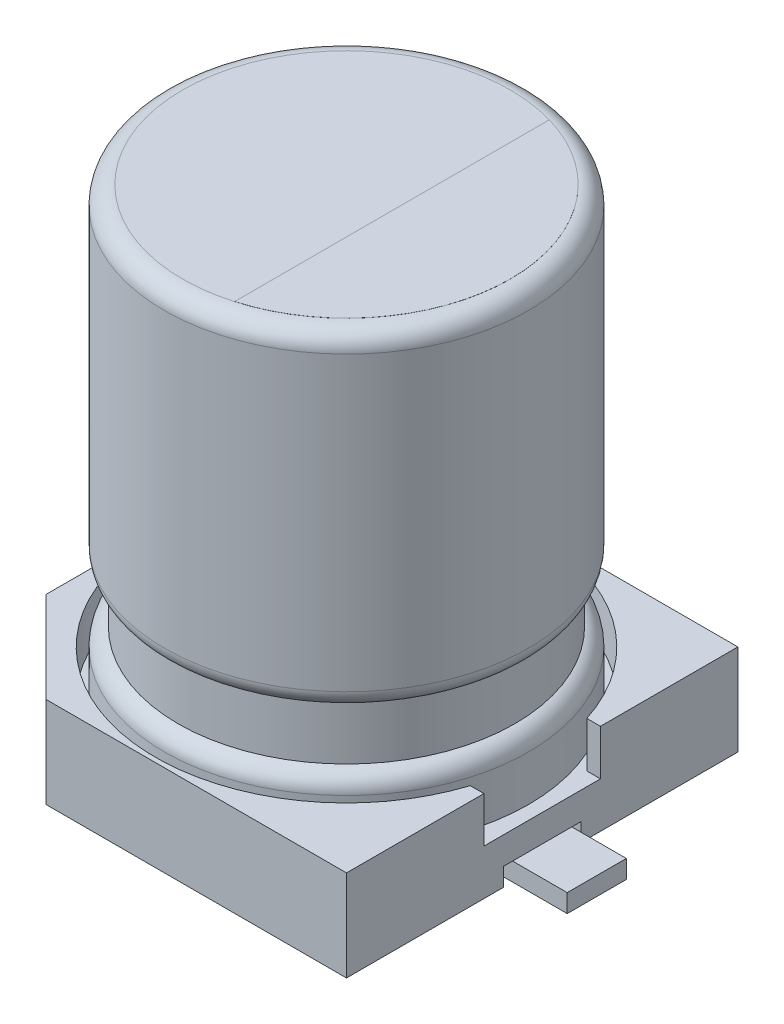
ISO-10303-21;
HEADER;
FILE_DESCRIPTION(('STEP AP214'),'2;1');
FILE_NAME('part.step','',(''),(''),'','','');
FILE_SCHEMA(('AUTOMOTIVE_DESIGN { 1 0 10303 214 1 1 1 1 }'));
ENDSEC;
DATA;
#1=APPLICATION_CONTEXT('core data for automotive mechanical design processes');
#2=APPLICATION_PROTOCOL_DEFINITION('international standard','automotive_design',2000,#1);
#3=PRODUCT_CONTEXT('',#1,'mechanical');
#4=PRODUCT('Part','Part','',(#3));
#5=PRODUCT_RELATED_PRODUCT_CATEGORY('part','',(#4));
#6=PRODUCT_DEFINITION_FORMATION('','',#4);
#7=PRODUCT_DEFINITION_CONTEXT('part definition',#1,'design');
#8=PRODUCT_DEFINITION('design','',#6,#7);
#9=PRODUCT_DEFINITION_SHAPE('','',#8);
#10=(LENGTH_UNIT() NAMED_UNIT(*) SI_UNIT(.MILLI.,.METRE.));
#11=(NAMED_UNIT(*) PLANE_ANGLE_UNIT() SI_UNIT($,.RADIAN.));
#12=(NAMED_UNIT(*) SI_UNIT($,.STERADIAN.) SOLID_ANGLE_UNIT());
#13=UNCERTAINTY_MEASURE_WITH_UNIT(LENGTH_MEASURE(1.E-05),#10,'distance_accuracy_value','');
#14=(GEOMETRIC_REPRESENTATION_CONTEXT(3) GLOBAL_UNCERTAINTY_ASSIGNED_CONTEXT((#13)) GLOBAL_UNIT_ASSIGNED_CONTEXT((#10,
#11,#12)) REPRESENTATION_CONTEXT('',''));
#15=CARTESIAN_POINT('',(0.,0.,0.));
#16=DIRECTION('',(0.,0.,1.));
#17=DIRECTION('',(1.,0.,0.));
#18=AXIS2_PLACEMENT_3D('',#15,#16,#17);
#19=CARTESIAN_POINT('',(0.4,0.2,0.425));
#20=DIRECTION('',(0.,-1.,0.));
#21=DIRECTION('',(1.,0.,0.));
#22=AXIS2_PLACEMENT_3D('',#19,#20,#21);
#23=PLANE('',#22);
#24=DIRECTION('',(0.,0.,-1.));
#25=VECTOR('',#24,1.);
#26=CARTESIAN_POINT('',(0.5,0.2,-0.325));
#27=LINE('',#26,#25);
#28=CARTESIAN_POINT('',(0.5,0.2,0.325));
#29=VERTEX_POINT('',#28);
#30=CARTESIAN_POINT('',(0.5,0.2,-0.325));
#31=VERTEX_POINT('',#30);
#32=EDGE_CURVE('E51',#29,#31,#27,.T.);
#33=ORIENTED_EDGE('',*,*,#32,.F.);
#34=DIRECTION('',(1.,0.,0.));
#35=VECTOR('',#34,1.);
#36=CARTESIAN_POINT('',(0.4,0.2,0.325));
#37=LINE('',#36,#35);
#38=CARTESIAN_POINT('',(2.15,0.2,0.324999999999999));
#39=VERTEX_POINT('',#38);
#40=EDGE_CURVE('E11',#29,#39,#37,.T.);
#41=ORIENTED_EDGE('',*,*,#40,.T.);
#42=DIRECTION('',(0.,0.,1.));
#43=VECTOR('',#42,1.);
#44=CARTESIAN_POINT('',(2.15,0.2,0.425000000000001));
#45=LINE('',#44,#43);
#46=CARTESIAN_POINT('',(2.15,0.2,0.425000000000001));
#47=VERTEX_POINT('',#46);
#48=EDGE_CURVE('E363',#39,#47,#45,.T.);
#49=ORIENTED_EDGE('',*,*,#48,.T.);
#50=DIRECTION('',(-1.,0.,0.));
#51=VECTOR('',#50,1.);
#52=CARTESIAN_POINT('',(2.15,0.2,0.425000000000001));
#53=LINE('',#52,#51);
#54=CARTESIAN_POINT('',(0.4,0.2,0.425));
#55=VERTEX_POINT('',#54);
#56=EDGE_CURVE('E350',#47,#55,#53,.T.);
#57=ORIENTED_EDGE('',*,*,#56,.T.);
#58=DIRECTION('',(0.,0.,-1.));
#59=VECTOR('',#58,1.);
#60=CARTESIAN_POINT('',(0.4,0.2,0.425));
#61=LINE('',#60,#59);
#62=CARTESIAN_POINT('',(0.4,0.2,-0.425));
#63=VERTEX_POINT('',#62);
#64=EDGE_CURVE('E354',#55,#63,#61,.T.);
#65=ORIENTED_EDGE('',*,*,#64,.T.);
#66=DIRECTION('',(1.,0.,0.));
#67=VECTOR('',#66,1.);
#68=CARTESIAN_POINT('',(2.15,0.2,-0.425000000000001));
#69=LINE('',#68,#67);
#70=CARTESIAN_POINT('',(2.15,0.2,-0.425000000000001));
#71=VERTEX_POINT('',#70);
#72=EDGE_CURVE('E359',#63,#71,#69,.T.);
#73=ORIENTED_EDGE('',*,*,#72,.T.);
#74=CARTESIAN_POINT('',(2.15,0.2,-0.325));
#75=VERTEX_POINT('',#74);
#76=EDGE_CURVE('E364',#71,#75,#45,.T.);
#77=ORIENTED_EDGE('',*,*,#76,.T.);
#78=DIRECTION('',(1.,0.,0.));
#79=VECTOR('',#78,1.);
#80=CARTESIAN_POINT('',(2.75,0.2,-0.325));
#81=LINE('',#80,#79);
#82=EDGE_CURVE('E288',#31,#75,#81,.T.);
#83=ORIENTED_EDGE('',*,*,#82,.F.);
#84=EDGE_LOOP('',(#33,#41,#49,#57,#65,#73,#77,#83));
#85=FACE_BOUND('',#84,.T.);
#86=ADVANCED_FACE('F35',(#85),#23,.T.);
#87=CARTESIAN_POINT('',(-2.15,0.2,-0.425));
#88=DIRECTION('',(0.,-1.,0.));
#89=DIRECTION('',(1.,0.,0.));
#90=AXIS2_PLACEMENT_3D('',#87,#88,#89);
#91=PLANE('',#90);
#92=DIRECTION('',(0.,0.,1.));
#93=VECTOR('',#92,1.);
#94=CARTESIAN_POINT('',(-0.5,0.2,-0.325));
#95=LINE('',#94,#93);
#96=CARTESIAN_POINT('',(-0.5,0.2,-0.325));
#97=VERTEX_POINT('',#96);
#98=CARTESIAN_POINT('',(-0.5,0.2,0.325));
#99=VERTEX_POINT('',#98);
#100=EDGE_CURVE('E59',#97,#99,#95,.T.);
#101=ORIENTED_EDGE('',*,*,#100,.F.);
#102=DIRECTION('',(-1.,0.,0.));
#103=VECTOR('',#102,1.);
#104=CARTESIAN_POINT('',(-2.15,0.2,-0.325));
#105=LINE('',#104,#103);
#106=CARTESIAN_POINT('',(-2.15,0.2,-0.325));
#107=VERTEX_POINT('',#106);
#108=EDGE_CURVE('E44',#97,#107,#105,.T.);
#109=ORIENTED_EDGE('',*,*,#108,.T.);
#110=DIRECTION('',(0.,0.,-1.));
#111=VECTOR('',#110,1.);
#112=CARTESIAN_POINT('',(-2.15,0.2,0.425));
#113=LINE('',#112,#111);
#114=CARTESIAN_POINT('',(-2.15,0.2,-0.425));
#115=VERTEX_POINT('',#114);
#116=EDGE_CURVE('E398',#107,#115,#113,.T.);
#117=ORIENTED_EDGE('',*,*,#116,.T.);
#118=DIRECTION('',(1.,0.,0.));
#119=VECTOR('',#118,1.);
#120=CARTESIAN_POINT('',(-2.15,0.2,-0.425));
#121=LINE('',#120,#119);
#122=CARTESIAN_POINT('',(-0.4,0.2,-0.425));
#123=VERTEX_POINT('',#122);
#124=EDGE_CURVE('E396',#115,#123,#121,.T.);
#125=ORIENTED_EDGE('',*,*,#124,.T.);
#126=DIRECTION('',(0.,0.,1.));
#127=VECTOR('',#126,1.);
#128=CARTESIAN_POINT('',(-0.4,0.2,0.425));
#129=LINE('',#128,#127);
#130=CARTESIAN_POINT('',(-0.4,0.2,0.425));
#131=VERTEX_POINT('',#130);
#132=EDGE_CURVE('E402',#123,#131,#129,.T.);
#133=ORIENTED_EDGE('',*,*,#132,.T.);
#134=DIRECTION('',(-1.,0.,0.));
#135=VECTOR('',#134,1.);
#136=CARTESIAN_POINT('',(-2.15,0.2,0.425));
#137=LINE('',#136,#135);
#138=CARTESIAN_POINT('',(-2.15,0.2,0.425));
#139=VERTEX_POINT('',#138);
#140=EDGE_CURVE('E406',#131,#139,#137,.T.);
#141=ORIENTED_EDGE('',*,*,#140,.T.);
#142=CARTESIAN_POINT('',(-2.15,0.2,0.325));
#143=VERTEX_POINT('',#142);
#144=EDGE_CURVE('E392',#139,#143,#113,.T.);
#145=ORIENTED_EDGE('',*,*,#144,.T.);
#146=DIRECTION('',(-1.,0.,0.));
#147=VECTOR('',#146,1.);
#148=CARTESIAN_POINT('',(-2.75,0.2,0.325));
#149=LINE('',#148,#147);
#150=EDGE_CURVE('E310',#99,#143,#149,.T.);
#151=ORIENTED_EDGE('',*,*,#150,.F.);
#152=EDGE_LOOP('',(#101,#109,#117,#125,#133,#141,#145,#151));
#153=FACE_BOUND('',#152,.T.);
#154=ADVANCED_FACE('F638',(#153),#91,.T.);
#155=CARTESIAN_POINT('',(2.15,0.5,-2.15));
#156=DIRECTION('',(0.,1.,0.));
#157=DIRECTION('',(0.,0.,1.));
#158=AXIS2_PLACEMENT_3D('',#155,#156,#157);
#159=PLANE('',#158);
#160=CARTESIAN_POINT('',(0.,0.5,0.));
#161=DIRECTION('',(0.,1.,0.));
#162=DIRECTION('',(0.,0.,1.));
#163=AXIS2_PLACEMENT_3D('',#160,#161,#162);
#164=CIRCLE('',#163,2.);
#165=CARTESIAN_POINT('',(0.,0.5,2.));
#166=VERTEX_POINT('',#165);
#167=EDGE_CURVE('E630',#166,#166,#164,.F.);
#168=ORIENTED_EDGE('',*,*,#167,.T.);
#169=EDGE_LOOP('',(#168));
#170=FACE_BOUND('',#169,.T.);
#171=CARTESIAN_POINT('',(0.,0.5,0.));
#172=DIRECTION('',(0.,-1.,0.));
#173=DIRECTION('',(0.,0.,1.));
#174=AXIS2_PLACEMENT_3D('',#171,#172,#173);
#175=CIRCLE('',#174,2.1);
#176=CARTESIAN_POINT('',(-2.,0.5,-0.640312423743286));
#177=VERTEX_POINT('',#176);
#178=CARTESIAN_POINT('',(2.,0.5,-0.640312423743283));
#179=VERTEX_POINT('',#178);
#180=EDGE_CURVE('E462',#177,#179,#175,.T.);
#181=ORIENTED_EDGE('',*,*,#180,.F.);
#182=DIRECTION('',(1.,0.,0.));
#183=VECTOR('',#182,1.);
#184=CARTESIAN_POINT('',(-2.15,0.5,-0.640312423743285));
#185=LINE('',#184,#183);
#186=CARTESIAN_POINT('',(-2.15,0.5,-0.640312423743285));
#187=VERTEX_POINT('',#186);
#188=EDGE_CURVE('E424',#187,#177,#185,.T.);
#189=ORIENTED_EDGE('',*,*,#188,.F.);
#190=DIRECTION('',(0.,0.,1.));
#191=VECTOR('',#190,1.);
#192=CARTESIAN_POINT('',(-2.15,0.5,1.15));
#193=LINE('',#192,#191);
#194=CARTESIAN_POINT('',(-2.15,0.5,0.640312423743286));
#195=VERTEX_POINT('',#194);
#196=EDGE_CURVE('E540',#187,#195,#193,.T.);
#197=ORIENTED_EDGE('',*,*,#196,.T.);
#198=DIRECTION('',(-1.,0.,0.));
#199=VECTOR('',#198,1.);
#200=CARTESIAN_POINT('',(-2.15,0.5,0.640312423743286));
#201=LINE('',#200,#199);
#202=CARTESIAN_POINT('',(-2.,0.5,0.640312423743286));
#203=VERTEX_POINT('',#202);
#204=EDGE_CURVE('E490',#203,#195,#201,.T.);
#205=ORIENTED_EDGE('',*,*,#204,.F.);
#206=CARTESIAN_POINT('',(0.,0.5,0.));
#207=DIRECTION('',(0.,-1.,0.));
#208=DIRECTION('',(0.,0.,1.));
#209=AXIS2_PLACEMENT_3D('',#206,#207,#208);
#210=CIRCLE('',#209,2.1);
#211=CARTESIAN_POINT('',(2.,0.5,0.640312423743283));
#212=VERTEX_POINT('',#211);
#213=EDGE_CURVE('E514',#212,#203,#210,.T.);
#214=ORIENTED_EDGE('',*,*,#213,.F.);
#215=DIRECTION('',(-1.,0.,0.));
#216=VECTOR('',#215,1.);
#217=CARTESIAN_POINT('',(2.,0.5,0.640312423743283));
#218=LINE('',#217,#216);
#219=CARTESIAN_POINT('',(2.15,0.5,0.640312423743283));
#220=VERTEX_POINT('',#219);
#221=EDGE_CURVE('E484',#220,#212,#218,.T.);
#222=ORIENTED_EDGE('',*,*,#221,.F.);
#223=DIRECTION('',(0.,0.,-1.));
#224=VECTOR('',#223,1.);
#225=CARTESIAN_POINT('',(2.15,0.5,2.15));
#226=LINE('',#225,#224);
#227=CARTESIAN_POINT('',(2.15,0.5,-0.640312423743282));
#228=VERTEX_POINT('',#227);
#229=EDGE_CURVE('E537',#220,#228,#226,.T.);
#230=ORIENTED_EDGE('',*,*,#229,.T.);
#231=DIRECTION('',(1.,0.,0.));
#232=VECTOR('',#231,1.);
#233=CARTESIAN_POINT('',(2.,0.5,-0.640312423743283));
#234=LINE('',#233,#232);
#235=EDGE_CURVE('E438',#179,#228,#234,.T.);
#236=ORIENTED_EDGE('',*,*,#235,.F.);
#237=EDGE_LOOP('',(#181,#189,#197,#205,#214,#222,#230,#236));
#238=FACE_BOUND('',#237,.T.);
#239=ADVANCED_FACE('F713',(#170,#238),#159,.T.);
#240=CARTESIAN_POINT('',(-1.8,5.4,0.));
#241=DIRECTION('',(0.,1.,0.));
#242=DIRECTION('',(-1.,0.,0.));
#243=AXIS2_PLACEMENT_3D('',#240,#241,#242);
#244=PLANE('',#243);
#245=CARTESIAN_POINT('',(0.,5.4,0.));
#246=DIRECTION('',(0.,1.,0.));
#247=DIRECTION('',(-1.,0.,0.));
#248=AXIS2_PLACEMENT_3D('',#245,#246,#247);
#249=CIRCLE('',#248,1.8);
#250=CARTESIAN_POINT('',(0.5,5.4,-1.72916164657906));
#251=VERTEX_POINT('',#250);
#252=CARTESIAN_POINT('',(0.5,5.4,1.72916164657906));
#253=VERTEX_POINT('',#252);
#254=EDGE_CURVE('E606',#251,#253,#249,.T.);
#255=ORIENTED_EDGE('',*,*,#254,.T.);
#256=DIRECTION('',(0.,0.,1.));
#257=VECTOR('',#256,1.);
#258=CARTESIAN_POINT('',(0.5,5.4,-1.72916164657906));
#259=LINE('',#258,#257);
#260=EDGE_CURVE('E588',#251,#253,#259,.T.);
#261=ORIENTED_EDGE('',*,*,#260,.F.);
#262=EDGE_LOOP('',(#255,#261));
#263=FACE_BOUND('',#262,.T.);
#264=ADVANCED_FACE('F684',(#263),#244,.T.);
#265=CARTESIAN_POINT('',(0.,5.4,0.));
#266=DIRECTION('',(0.,1.,0.));
#267=DIRECTION('',(-1.,0.,0.));
#268=AXIS2_PLACEMENT_3D('',#265,#266,#267);
#269=CYLINDRICAL_SURFACE('',#268,2.);
#270=ORIENTED_EDGE('',*,*,#167,.F.);
#271=EDGE_LOOP('',(#270));
#272=FACE_BOUND('',#271,.T.);
#273=CARTESIAN_POINT('',(0.,1.,0.));
#274=DIRECTION('',(0.,1.,0.));
#275=DIRECTION('',(-1.,0.,0.));
#276=AXIS2_PLACEMENT_3D('',#273,#274,#275);
#277=CIRCLE('',#276,2.);
#278=CARTESIAN_POINT('',(-2.,1.,0.));
#279=VERTEX_POINT('',#278);
#280=EDGE_CURVE('E626',#279,#279,#277,.T.);
#281=ORIENTED_EDGE('',*,*,#280,.F.);
#282=EDGE_LOOP('',(#281));
#283=FACE_BOUND('',#282,.T.);
#284=ADVANCED_FACE('F1174',(#272,#283),#269,.T.);
#285=CARTESIAN_POINT('',(0.,1.,0.));
#286=DIRECTION('',(0.,1.,0.));
#287=DIRECTION('',(-1.,0.,0.));
#288=AXIS2_PLACEMENT_3D('',#285,#286,#287);
#289=TOROIDAL_SURFACE('',#288,1.8,0.2);
#290=ORIENTED_EDGE('',*,*,#280,.T.);
#291=EDGE_LOOP('',(#290));
#292=FACE_BOUND('',#291,.T.);
#293=CARTESIAN_POINT('',(0.,1.19364916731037,0.));
#294=DIRECTION('',(0.,1.,0.));
#295=DIRECTION('',(-1.,0.,0.));
#296=AXIS2_PLACEMENT_3D('',#293,#294,#295);
#297=CIRCLE('',#296,1.85);
#298=CARTESIAN_POINT('',(-1.85,1.19364916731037,0.));
#299=VERTEX_POINT('',#298);
#300=EDGE_CURVE('E622',#299,#299,#297,.T.);
#301=ORIENTED_EDGE('',*,*,#300,.F.);
#302=EDGE_LOOP('',(#301));
#303=FACE_BOUND('',#302,.T.);
#304=ADVANCED_FACE('F1212',(#292,#303),#289,.T.);
#305=CARTESIAN_POINT('',(0.,5.4,0.));
#306=DIRECTION('',(0.,1.,0.));
#307=DIRECTION('',(-1.,0.,0.));
#308=AXIS2_PLACEMENT_3D('',#305,#306,#307);
#309=CYLINDRICAL_SURFACE('',#308,1.85);
#310=ORIENTED_EDGE('',*,*,#300,.T.);
#311=EDGE_LOOP('',(#310));
#312=FACE_BOUND('',#311,.T.);
#313=CARTESIAN_POINT('',(0.,1.79364916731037,0.));
#314=DIRECTION('',(0.,1.,0.));
#315=DIRECTION('',(-1.,0.,0.));
#316=AXIS2_PLACEMENT_3D('',#313,#314,#315);
#317=CIRCLE('',#316,1.85);
#318=CARTESIAN_POINT('',(-1.85,1.79364916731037,0.));
#319=VERTEX_POINT('',#318);
#320=EDGE_CURVE('E618',#319,#319,#317,.T.);
#321=ORIENTED_EDGE('',*,*,#320,.F.);
#322=EDGE_LOOP('',(#321));
#323=FACE_BOUND('',#322,.T.);
#324=ADVANCED_FACE('F1202',(#312,#323),#309,.T.);
#325=CARTESIAN_POINT('',(0.,1.98729833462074,0.));
#326=DIRECTION('',(0.,1.,0.));
#327=DIRECTION('',(-1.,0.,0.));
#328=AXIS2_PLACEMENT_3D('',#325,#326,#327);
#329=TOROIDAL_SURFACE('',#328,1.8,0.2);
#330=ORIENTED_EDGE('',*,*,#320,.T.);
#331=EDGE_LOOP('',(#330));
#332=FACE_BOUND('',#331,.T.);
#333=CARTESIAN_POINT('',(0.,1.98729833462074,0.));
#334=DIRECTION('',(0.,1.,0.));
#335=DIRECTION('',(-1.,0.,0.));
#336=AXIS2_PLACEMENT_3D('',#333,#334,#335);
#337=CIRCLE('',#336,2.);
#338=CARTESIAN_POINT('',(-2.,1.98729833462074,0.));
#339=VERTEX_POINT('',#338);
#340=EDGE_CURVE('E614',#339,#339,#337,.T.);
#341=ORIENTED_EDGE('',*,*,#340,.F.);
#342=EDGE_LOOP('',(#341));
#343=FACE_BOUND('',#342,.T.);
#344=ADVANCED_FACE('F1192',(#332,#343),#329,.T.);
#345=CARTESIAN_POINT('',(0.,5.4,0.));
#346=DIRECTION('',(0.,1.,0.));
#347=DIRECTION('',(-1.,0.,0.));
#348=AXIS2_PLACEMENT_3D('',#345,#346,#347);
#349=CYLINDRICAL_SURFACE('',#348,2.);
#350=ORIENTED_EDGE('',*,*,#340,.T.);
#351=EDGE_LOOP('',(#350));
#352=FACE_BOUND('',#351,.T.);
#353=CARTESIAN_POINT('',(0.,5.2,0.));
#354=DIRECTION('',(0.,1.,0.));
#355=DIRECTION('',(-1.,0.,0.));
#356=AXIS2_PLACEMENT_3D('',#353,#354,#355);
#357=CIRCLE('',#356,2.);
#358=CARTESIAN_POINT('',(-2.,5.2,0.));
#359=VERTEX_POINT('',#358);
#360=EDGE_CURVE('E610',#359,#359,#357,.T.);
#361=ORIENTED_EDGE('',*,*,#360,.F.);
#362=EDGE_LOOP('',(#361));
#363=FACE_BOUND('',#362,.T.);
#364=ADVANCED_FACE('F1183',(#352,#363),#349,.T.);
#365=CARTESIAN_POINT('',(0.,5.2,0.));
#366=DIRECTION('',(0.,1.,0.));
#367=DIRECTION('',(-1.,0.,0.));
#368=AXIS2_PLACEMENT_3D('',#365,#366,#367);
#369=TOROIDAL_SURFACE('',#368,1.8,0.2);
#370=ORIENTED_EDGE('',*,*,#360,.T.);
#371=EDGE_LOOP('',(#370));
#372=FACE_BOUND('',#371,.T.);
#373=EDGE_CURVE('E607',#253,#251,#249,.T.);
#374=ORIENTED_EDGE('',*,*,#373,.F.);
#375=ORIENTED_EDGE('',*,*,#254,.F.);
#376=EDGE_LOOP('',(#374,#375));
#377=FACE_BOUND('',#376,.T.);
#378=ADVANCED_FACE('F686',(#372,#377),#369,.T.);
#379=CARTESIAN_POINT('',(0.,5.401,0.));
#380=DIRECTION('',(0.,-1.,0.));
#381=DIRECTION('',(1.,0.,0.));
#382=AXIS2_PLACEMENT_3D('',#379,#380,#381);
#383=CYLINDRICAL_SURFACE('',#382,1.8);
#384=ORIENTED_EDGE('',*,*,#373,.T.);
#385=DIRECTION('',(0.,-1.,0.));
#386=VECTOR('',#385,1.);
#387=CARTESIAN_POINT('',(0.5,5.401,-1.72916164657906));
#388=LINE('',#387,#386);
#389=CARTESIAN_POINT('',(0.5,5.401,-1.72916164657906));
#390=VERTEX_POINT('',#389);
#391=EDGE_CURVE('E602',#390,#251,#388,.T.);
#392=ORIENTED_EDGE('',*,*,#391,.F.);
#393=CARTESIAN_POINT('',(0.,5.401,0.));
#394=DIRECTION('',(0.,1.,0.));
#395=DIRECTION('',(-1.,0.,0.));
#396=AXIS2_PLACEMENT_3D('',#393,#394,#395);
#397=CIRCLE('',#396,1.8);
#398=CARTESIAN_POINT('',(0.5,5.401,1.72916164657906));
#399=VERTEX_POINT('',#398);
#400=EDGE_CURVE('E589',#399,#390,#397,.T.);
#401=ORIENTED_EDGE('',*,*,#400,.F.);
#402=DIRECTION('',(0.,-1.,0.));
#403=VECTOR('',#402,1.);
#404=CARTESIAN_POINT('',(0.5,5.401,1.72916164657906));
#405=LINE('',#404,#403);
#406=EDGE_CURVE('E596',#399,#253,#405,.T.);
#407=ORIENTED_EDGE('',*,*,#406,.T.);
#408=EDGE_LOOP('',(#384,#392,#401,#407));
#409=FACE_BOUND('',#408,.T.);
#410=ADVANCED_FACE('F689',(#409),#383,.T.);
#411=CARTESIAN_POINT('',(0.5,5.401,-1.72916164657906));
#412=DIRECTION('',(1.,0.,0.));
#413=DIRECTION('',(0.,1.,0.));
#414=AXIS2_PLACEMENT_3D('',#411,#412,#413);
#415=PLANE('',#414);
#416=ORIENTED_EDGE('',*,*,#260,.T.);
#417=ORIENTED_EDGE('',*,*,#406,.F.);
#418=DIRECTION('',(0.,0.,1.));
#419=VECTOR('',#418,1.);
#420=CARTESIAN_POINT('',(0.5,5.401,-1.72916164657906));
#421=LINE('',#420,#419);
#422=EDGE_CURVE('E593',#390,#399,#421,.T.);
#423=ORIENTED_EDGE('',*,*,#422,.F.);
#424=ORIENTED_EDGE('',*,*,#391,.T.);
#425=EDGE_LOOP('',(#416,#417,#423,#424));
#426=FACE_BOUND('',#425,.T.);
#427=ADVANCED_FACE('F693',(#426),#415,.F.);
#428=CARTESIAN_POINT('',(0.,5.401,0.));
#429=DIRECTION('',(0.,1.,0.));
#430=DIRECTION('',(-1.,0.,0.));
#431=AXIS2_PLACEMENT_3D('',#428,#429,#430);
#432=PLANE('',#431);
#433=ORIENTED_EDGE('',*,*,#400,.T.);
#434=ORIENTED_EDGE('',*,*,#422,.T.);
#435=EDGE_LOOP('',(#433,#434));
#436=FACE_BOUND('',#435,.T.);
#437=ADVANCED_FACE('F695',(#436),#432,.T.);
#438=CARTESIAN_POINT('',(2.15,0.5,2.15));
#439=DIRECTION('',(-1.,0.,0.));
#440=DIRECTION('',(0.,0.,1.));
#441=AXIS2_PLACEMENT_3D('',#438,#439,#440);
#442=PLANE('',#441);
#443=DIRECTION('',(0.,0.,-1.));
#444=VECTOR('',#443,1.);
#445=CARTESIAN_POINT('',(2.15,0.,2.15));
#446=LINE('',#445,#444);
#447=CARTESIAN_POINT('',(2.15,0.,2.15));
#448=VERTEX_POINT('',#447);
#449=CARTESIAN_POINT('',(2.15,0.,0.425000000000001));
#450=VERTEX_POINT('',#449);
#451=EDGE_CURVE('E545',#448,#450,#446,.T.);
#452=ORIENTED_EDGE('',*,*,#451,.T.);
#453=DIRECTION('',(0.,-1.,0.));
#454=VECTOR('',#453,1.);
#455=CARTESIAN_POINT('',(2.15,0.2,0.425000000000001));
#456=LINE('',#455,#454);
#457=EDGE_CURVE('E378',#47,#450,#456,.T.);
#458=ORIENTED_EDGE('',*,*,#457,.F.);
#459=ORIENTED_EDGE('',*,*,#48,.F.);
#460=EDGE_CURVE('E369',#75,#39,#45,.T.);
#461=ORIENTED_EDGE('',*,*,#460,.F.);
#462=ORIENTED_EDGE('',*,*,#76,.F.);
#463=DIRECTION('',(0.,-1.,0.));
#464=VECTOR('',#463,1.);
#465=CARTESIAN_POINT('',(2.15,0.2,-0.425000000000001));
#466=LINE('',#465,#464);
#467=CARTESIAN_POINT('',(2.15,0.,-0.425000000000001));
#468=VERTEX_POINT('',#467);
#469=EDGE_CURVE('E382',#71,#468,#466,.T.);
#470=ORIENTED_EDGE('',*,*,#469,.T.);
#471=CARTESIAN_POINT('',(2.15,0.,-2.15));
#472=VERTEX_POINT('',#471);
#473=EDGE_CURVE('E536',#468,#472,#446,.T.);
#474=ORIENTED_EDGE('',*,*,#473,.T.);
#475=DIRECTION('',(0.,-1.,0.));
#476=VECTOR('',#475,1.);
#477=CARTESIAN_POINT('',(2.15,0.5,-2.15));
#478=LINE('',#477,#476);
#479=CARTESIAN_POINT('',(2.15,1.,-2.15));
#480=VERTEX_POINT('',#479);
#481=EDGE_CURVE('E584',#480,#472,#478,.T.);
#482=ORIENTED_EDGE('',*,*,#481,.F.);
#483=DIRECTION('',(0.,0.,-1.));
#484=VECTOR('',#483,1.);
#485=CARTESIAN_POINT('',(2.15,1.,-0.640312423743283));
#486=LINE('',#485,#484);
#487=CARTESIAN_POINT('',(2.15,1.,-0.640312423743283));
#488=VERTEX_POINT('',#487);
#489=EDGE_CURVE('E433',#488,#480,#486,.T.);
#490=ORIENTED_EDGE('',*,*,#489,.F.);
#491=DIRECTION('',(0.,-1.,0.));
#492=VECTOR('',#491,1.);
#493=CARTESIAN_POINT('',(2.15,1.,-0.640312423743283));
#494=LINE('',#493,#492);
#495=EDGE_CURVE('E458',#488,#228,#494,.T.);
#496=ORIENTED_EDGE('',*,*,#495,.T.);
#497=ORIENTED_EDGE('',*,*,#229,.F.);
#498=DIRECTION('',(0.,-1.,0.));
#499=VECTOR('',#498,1.);
#500=CARTESIAN_POINT('',(2.15,1.,0.640312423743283));
#501=LINE('',#500,#499);
#502=CARTESIAN_POINT('',(2.15,1.,0.640312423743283));
#503=VERTEX_POINT('',#502);
#504=EDGE_CURVE('E532',#503,#220,#501,.T.);
#505=ORIENTED_EDGE('',*,*,#504,.F.);
#506=DIRECTION('',(0.,0.,-1.));
#507=VECTOR('',#506,1.);
#508=CARTESIAN_POINT('',(2.15,1.,2.15));
#509=LINE('',#508,#507);
#510=CARTESIAN_POINT('',(2.15,1.,2.15));
#511=VERTEX_POINT('',#510);
#512=EDGE_CURVE('E489',#511,#503,#509,.T.);
#513=ORIENTED_EDGE('',*,*,#512,.F.);
#514=DIRECTION('',(0.,-1.,0.));
#515=VECTOR('',#514,1.);
#516=CARTESIAN_POINT('',(2.15,0.5,2.15));
#517=LINE('',#516,#515);
#518=EDGE_CURVE('E544',#511,#448,#517,.T.);
#519=ORIENTED_EDGE('',*,*,#518,.T.);
#520=EDGE_LOOP('',(#452,#458,#459,#461,#462,#470,#474,#482,#490,#496,#497,#505,#513,#519));
#521=FACE_BOUND('',#520,.T.);
#522=ADVANCED_FACE('F697',(#521),#442,.F.);
#523=CARTESIAN_POINT('',(2.15,0.5,-2.15));
#524=DIRECTION('',(0.,0.,1.));
#525=DIRECTION('',(1.,0.,0.));
#526=AXIS2_PLACEMENT_3D('',#523,#524,#525);
#527=PLANE('',#526);
#528=DIRECTION('',(-1.,0.,0.));
#529=VECTOR('',#528,1.);
#530=CARTESIAN_POINT('',(2.15,0.,-2.15));
#531=LINE('',#530,#529);
#532=CARTESIAN_POINT('',(-1.15,0.,-2.15));
#533=VERTEX_POINT('',#532);
#534=EDGE_CURVE('E549',#472,#533,#531,.T.);
#535=ORIENTED_EDGE('',*,*,#534,.T.);
#536=DIRECTION('',(0.,-1.,0.));
#537=VECTOR('',#536,1.);
#538=CARTESIAN_POINT('',(-1.15,0.5,-2.15));
#539=LINE('',#538,#537);
#540=CARTESIAN_POINT('',(-1.15,1.,-2.15));
#541=VERTEX_POINT('',#540);
#542=EDGE_CURVE('E580',#541,#533,#539,.T.);
#543=ORIENTED_EDGE('',*,*,#542,.F.);
#544=DIRECTION('',(-1.,0.,0.));
#545=VECTOR('',#544,1.);
#546=CARTESIAN_POINT('',(2.15,1.,-2.15));
#547=LINE('',#546,#545);
#548=EDGE_CURVE('E437',#480,#541,#547,.T.);
#549=ORIENTED_EDGE('',*,*,#548,.F.);
#550=ORIENTED_EDGE('',*,*,#481,.T.);
#551=EDGE_LOOP('',(#535,#543,#549,#550));
#552=FACE_BOUND('',#551,.T.);
#553=ADVANCED_FACE('F703',(#552),#527,.F.);
#554=CARTESIAN_POINT('',(-1.15,0.5,-2.15));
#555=DIRECTION('',(0.707106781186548,0.,0.707106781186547));
#556=DIRECTION('',(0.707106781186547,0.,-0.707106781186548));
#557=AXIS2_PLACEMENT_3D('',#554,#555,#556);
#558=PLANE('',#557);
#559=DIRECTION('',(-0.707106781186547,0.,0.707106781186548));
#560=VECTOR('',#559,1.);
#561=CARTESIAN_POINT('',(-1.15,0.,-2.15));
#562=LINE('',#561,#560);
#563=CARTESIAN_POINT('',(-2.15,0.,-1.15));
#564=VERTEX_POINT('',#563);
#565=EDGE_CURVE('E552',#533,#564,#562,.T.);
#566=ORIENTED_EDGE('',*,*,#565,.T.);
#567=DIRECTION('',(0.,-1.,0.));
#568=VECTOR('',#567,1.);
#569=CARTESIAN_POINT('',(-2.15,0.5,-1.15));
#570=LINE('',#569,#568);
#571=CARTESIAN_POINT('',(-2.15,1.,-1.15));
#572=VERTEX_POINT('',#571);
#573=EDGE_CURVE('E576',#572,#564,#570,.T.);
#574=ORIENTED_EDGE('',*,*,#573,.F.);
#575=DIRECTION('',(-0.707106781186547,0.,0.707106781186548));
#576=VECTOR('',#575,1.);
#577=CARTESIAN_POINT('',(-1.15,1.,-2.15));
#578=LINE('',#577,#576);
#579=EDGE_CURVE('E442',#541,#572,#578,.T.);
#580=ORIENTED_EDGE('',*,*,#579,.F.);
#581=ORIENTED_EDGE('',*,*,#542,.T.);
#582=EDGE_LOOP('',(#566,#574,#580,#581));
#583=FACE_BOUND('',#582,.T.);
#584=ADVANCED_FACE('F786',(#583),#558,.F.);
#585=CARTESIAN_POINT('',(-2.15,0.5,1.15));
#586=DIRECTION('',(1.,0.,0.));
#587=DIRECTION('',(0.,0.,-1.));
#588=AXIS2_PLACEMENT_3D('',#585,#586,#587);
#589=PLANE('',#588);
#590=ORIENTED_EDGE('',*,*,#144,.F.);
#591=DIRECTION('',(0.,-1.,0.));
#592=VECTOR('',#591,1.);
#593=CARTESIAN_POINT('',(-2.15,0.2,0.425));
#594=LINE('',#593,#592);
#595=CARTESIAN_POINT('',(-2.15,0.,0.425));
#596=VERTEX_POINT('',#595);
#597=EDGE_CURVE('E420',#139,#596,#594,.T.);
#598=ORIENTED_EDGE('',*,*,#597,.T.);
#599=DIRECTION('',(0.,0.,1.));
#600=VECTOR('',#599,1.);
#601=CARTESIAN_POINT('',(-2.15,0.,1.15));
#602=LINE('',#601,#600);
#603=CARTESIAN_POINT('',(-2.15,0.,1.15));
#604=VERTEX_POINT('',#603);
#605=EDGE_CURVE('E555',#596,#604,#602,.T.);
#606=ORIENTED_EDGE('',*,*,#605,.T.);
#607=DIRECTION('',(0.,-1.,0.));
#608=VECTOR('',#607,1.);
#609=CARTESIAN_POINT('',(-2.15,0.5,1.15));
#610=LINE('',#609,#608);
#611=CARTESIAN_POINT('',(-2.15,1.,1.15));
#612=VERTEX_POINT('',#611);
#613=EDGE_CURVE('E572',#612,#604,#610,.T.);
#614=ORIENTED_EDGE('',*,*,#613,.F.);
#615=DIRECTION('',(0.,0.,1.));
#616=VECTOR('',#615,1.);
#617=CARTESIAN_POINT('',(-2.15,1.,0.640312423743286));
#618=LINE('',#617,#616);
#619=CARTESIAN_POINT('',(-2.15,1.,0.640312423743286));
#620=VERTEX_POINT('',#619);
#621=EDGE_CURVE('E502',#620,#612,#618,.T.);
#622=ORIENTED_EDGE('',*,*,#621,.F.);
#623=DIRECTION('',(0.,-1.,0.));
#624=VECTOR('',#623,1.);
#625=CARTESIAN_POINT('',(-2.15,1.,0.640312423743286));
#626=LINE('',#625,#624);
#627=EDGE_CURVE('E510',#620,#195,#626,.T.);
#628=ORIENTED_EDGE('',*,*,#627,.T.);
#629=ORIENTED_EDGE('',*,*,#196,.F.);
#630=DIRECTION('',(0.,-1.,0.));
#631=VECTOR('',#630,1.);
#632=CARTESIAN_POINT('',(-2.15,1.,-0.640312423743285));
#633=LINE('',#632,#631);
#634=CARTESIAN_POINT('',(-2.15,1.,-0.640312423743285));
#635=VERTEX_POINT('',#634);
#636=EDGE_CURVE('E480',#635,#187,#633,.T.);
#637=ORIENTED_EDGE('',*,*,#636,.F.);
#638=DIRECTION('',(0.,0.,1.));
#639=VECTOR('',#638,1.);
#640=CARTESIAN_POINT('',(-2.15,1.,-1.15));
#641=LINE('',#640,#639);
#642=EDGE_CURVE('E446',#572,#635,#641,.T.);
#643=ORIENTED_EDGE('',*,*,#642,.F.);
#644=ORIENTED_EDGE('',*,*,#573,.T.);
#645=CARTESIAN_POINT('',(-2.15,0.,-0.425));
#646=VERTEX_POINT('',#645);
#647=EDGE_CURVE('E556',#564,#646,#602,.T.);
#648=ORIENTED_EDGE('',*,*,#647,.T.);
#649=DIRECTION('',(0.,-1.,0.));
#650=VECTOR('',#649,1.);
#651=CARTESIAN_POINT('',(-2.15,0.2,-0.425));
#652=LINE('',#651,#650);
#653=EDGE_CURVE('E409',#115,#646,#652,.T.);
#654=ORIENTED_EDGE('',*,*,#653,.F.);
#655=ORIENTED_EDGE('',*,*,#116,.F.);
#656=EDGE_CURVE('E397',#143,#107,#113,.T.);
#657=ORIENTED_EDGE('',*,*,#656,.F.);
#658=EDGE_LOOP('',(#590,#598,#606,#614,#622,#628,#629,#637,#643,#644,#648,#654,#655,#657));
#659=FACE_BOUND('',#658,.T.);
#660=ADVANCED_FACE('F646',(#659),#589,.F.);
#661=CARTESIAN_POINT('',(-1.15,0.5,2.15));
#662=DIRECTION('',(0.707106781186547,0.,-0.707106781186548));
#663=DIRECTION('',(-0.707106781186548,0.,-0.707106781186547));
#664=AXIS2_PLACEMENT_3D('',#661,#662,#663);
#665=PLANE('',#664);
#666=DIRECTION('',(0.707106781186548,0.,0.707106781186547));
#667=VECTOR('',#666,1.);
#668=CARTESIAN_POINT('',(-1.15,0.,2.15));
#669=LINE('',#668,#667);
#670=CARTESIAN_POINT('',(-1.15,0.,2.15));
#671=VERTEX_POINT('',#670);
#672=EDGE_CURVE('E560',#604,#671,#669,.T.);
#673=ORIENTED_EDGE('',*,*,#672,.T.);
#674=DIRECTION('',(0.,-1.,0.));
#675=VECTOR('',#674,1.);
#676=CARTESIAN_POINT('',(-1.15,0.5,2.15));
#677=LINE('',#676,#675);
#678=CARTESIAN_POINT('',(-1.15,1.,2.15));
#679=VERTEX_POINT('',#678);
#680=EDGE_CURVE('E568',#679,#671,#677,.T.);
#681=ORIENTED_EDGE('',*,*,#680,.F.);
#682=DIRECTION('',(0.707106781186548,0.,0.707106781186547));
#683=VECTOR('',#682,1.);
#684=CARTESIAN_POINT('',(-2.15,1.,1.15));
#685=LINE('',#684,#683);
#686=EDGE_CURVE('E506',#612,#679,#685,.T.);
#687=ORIENTED_EDGE('',*,*,#686,.F.);
#688=ORIENTED_EDGE('',*,*,#613,.T.);
#689=EDGE_LOOP('',(#673,#681,#687,#688));
#690=FACE_BOUND('',#689,.T.);
#691=ADVANCED_FACE('F779',(#690),#665,.F.);
#692=CARTESIAN_POINT('',(2.15,0.5,2.15));
#693=DIRECTION('',(0.,0.,-1.));
#694=DIRECTION('',(-1.,0.,0.));
#695=AXIS2_PLACEMENT_3D('',#692,#693,#694);
#696=PLANE('',#695);
#697=DIRECTION('',(1.,0.,0.));
#698=VECTOR('',#697,1.);
#699=CARTESIAN_POINT('',(2.15,0.,2.15));
#700=LINE('',#699,#698);
#701=EDGE_CURVE('E541',#671,#448,#700,.T.);
#702=ORIENTED_EDGE('',*,*,#701,.T.);
#703=ORIENTED_EDGE('',*,*,#518,.F.);
#704=DIRECTION('',(1.,0.,0.));
#705=VECTOR('',#704,1.);
#706=CARTESIAN_POINT('',(-1.15,1.,2.15));
#707=LINE('',#706,#705);
#708=EDGE_CURVE('E485',#679,#511,#707,.T.);
#709=ORIENTED_EDGE('',*,*,#708,.F.);
#710=ORIENTED_EDGE('',*,*,#680,.T.);
#711=EDGE_LOOP('',(#702,#703,#709,#710));
#712=FACE_BOUND('',#711,.T.);
#713=ADVANCED_FACE('F776',(#712),#696,.F.);
#714=CARTESIAN_POINT('',(0.,0.,0.));
#715=DIRECTION('',(0.,-1.,0.));
#716=DIRECTION('',(1.,0.,0.));
#717=AXIS2_PLACEMENT_3D('',#714,#715,#716);
#718=PLANE('',#717);
#719=DIRECTION('',(-1.,0.,0.));
#720=VECTOR('',#719,1.);
#721=CARTESIAN_POINT('',(2.15,0.,0.425000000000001));
#722=LINE('',#721,#720);
#723=CARTESIAN_POINT('',(0.4,0.,0.425));
#724=VERTEX_POINT('',#723);
#725=EDGE_CURVE('E318',#450,#724,#722,.T.);
#726=ORIENTED_EDGE('',*,*,#725,.F.);
#727=ORIENTED_EDGE('',*,*,#451,.F.);
#728=ORIENTED_EDGE('',*,*,#701,.F.);
#729=ORIENTED_EDGE('',*,*,#672,.F.);
#730=ORIENTED_EDGE('',*,*,#605,.F.);
#731=DIRECTION('',(-1.,0.,0.));
#732=VECTOR('',#731,1.);
#733=CARTESIAN_POINT('',(-2.15,0.,0.425));
#734=LINE('',#733,#732);
#735=CARTESIAN_POINT('',(-0.4,0.,0.425));
#736=VERTEX_POINT('',#735);
#737=EDGE_CURVE('E417',#736,#596,#734,.T.);
#738=ORIENTED_EDGE('',*,*,#737,.F.);
#739=DIRECTION('',(0.,0.,1.));
#740=VECTOR('',#739,1.);
#741=CARTESIAN_POINT('',(-0.4,0.,0.425));
#742=LINE('',#741,#740);
#743=CARTESIAN_POINT('',(-0.4,0.,-0.425));
#744=VERTEX_POINT('',#743);
#745=EDGE_CURVE('E413',#744,#736,#742,.T.);
#746=ORIENTED_EDGE('',*,*,#745,.F.);
#747=DIRECTION('',(1.,0.,0.));
#748=VECTOR('',#747,1.);
#749=CARTESIAN_POINT('',(-2.15,0.,-0.425));
#750=LINE('',#749,#748);
#751=EDGE_CURVE('E381',#646,#744,#750,.T.);
#752=ORIENTED_EDGE('',*,*,#751,.F.);
#753=ORIENTED_EDGE('',*,*,#647,.F.);
#754=ORIENTED_EDGE('',*,*,#565,.F.);
#755=ORIENTED_EDGE('',*,*,#534,.F.);
#756=ORIENTED_EDGE('',*,*,#473,.F.);
#757=DIRECTION('',(1.,0.,0.));
#758=VECTOR('',#757,1.);
#759=CARTESIAN_POINT('',(2.15,0.,-0.425000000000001));
#760=LINE('',#759,#758);
#761=CARTESIAN_POINT('',(0.4,0.,-0.425));
#762=VERTEX_POINT('',#761);
#763=EDGE_CURVE('E355',#762,#468,#760,.T.);
#764=ORIENTED_EDGE('',*,*,#763,.F.);
#765=DIRECTION('',(0.,0.,-1.));
#766=VECTOR('',#765,1.);
#767=CARTESIAN_POINT('',(0.4,0.,0.425));
#768=LINE('',#767,#766);
#769=EDGE_CURVE('E372',#724,#762,#768,.T.);
#770=ORIENTED_EDGE('',*,*,#769,.F.);
#771=EDGE_LOOP('',(#726,#727,#728,#729,#730,#738,#746,#752,#753,#754,#755,#756,#764,#770));
#772=FACE_BOUND('',#771,.T.);
#773=ADVANCED_FACE('F37',(#772),#718,.T.);
#774=CARTESIAN_POINT('',(2.,1.,0.640312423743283));
#775=DIRECTION('',(0.,0.,1.));
#776=DIRECTION('',(1.,0.,0.));
#777=AXIS2_PLACEMENT_3D('',#774,#775,#776);
#778=PLANE('',#777);
#779=ORIENTED_EDGE('',*,*,#221,.T.);
#780=DIRECTION('',(0.,-1.,0.));
#781=VECTOR('',#780,1.);
#782=CARTESIAN_POINT('',(2.,1.,0.640312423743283));
#783=LINE('',#782,#781);
#784=CARTESIAN_POINT('',(2.,1.,0.640312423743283));
#785=VERTEX_POINT('',#784);
#786=EDGE_CURVE('E528',#785,#212,#783,.T.);
#787=ORIENTED_EDGE('',*,*,#786,.F.);
#788=DIRECTION('',(-1.,0.,0.));
#789=VECTOR('',#788,1.);
#790=CARTESIAN_POINT('',(2.,1.,0.640312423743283));
#791=LINE('',#790,#789);
#792=EDGE_CURVE('E493',#503,#785,#791,.T.);
#793=ORIENTED_EDGE('',*,*,#792,.F.);
#794=ORIENTED_EDGE('',*,*,#504,.T.);
#795=EDGE_LOOP('',(#779,#787,#793,#794));
#796=FACE_BOUND('',#795,.T.);
#797=ADVANCED_FACE('F768',(#796),#778,.F.);
#798=CARTESIAN_POINT('',(0.,1.,0.));
#799=DIRECTION('',(0.,-1.,0.));
#800=DIRECTION('',(0.,0.,-1.));
#801=AXIS2_PLACEMENT_3D('',#798,#799,#800);
#802=CYLINDRICAL_SURFACE('',#801,2.1);
#803=ORIENTED_EDGE('',*,*,#213,.T.);
#804=DIRECTION('',(0.,-1.,0.));
#805=VECTOR('',#804,1.);
#806=CARTESIAN_POINT('',(-2.,1.,0.640312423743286));
#807=LINE('',#806,#805);
#808=CARTESIAN_POINT('',(-2.,1.,0.640312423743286));
#809=VERTEX_POINT('',#808);
#810=EDGE_CURVE('E524',#809,#203,#807,.T.);
#811=ORIENTED_EDGE('',*,*,#810,.F.);
#812=CARTESIAN_POINT('',(0.,1.,0.));
#813=DIRECTION('',(0.,-1.,0.));
#814=DIRECTION('',(0.,0.,1.));
#815=AXIS2_PLACEMENT_3D('',#812,#813,#814);
#816=CIRCLE('',#815,2.1);
#817=EDGE_CURVE('E496',#785,#809,#816,.T.);
#818=ORIENTED_EDGE('',*,*,#817,.F.);
#819=ORIENTED_EDGE('',*,*,#786,.T.);
#820=EDGE_LOOP('',(#803,#811,#818,#819));
#821=FACE_BOUND('',#820,.T.);
#822=ADVANCED_FACE('F764',(#821),#802,.F.);
#823=CARTESIAN_POINT('',(-2.15,1.,0.640312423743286));
#824=DIRECTION('',(0.,0.,1.));
#825=DIRECTION('',(1.,0.,0.));
#826=AXIS2_PLACEMENT_3D('',#823,#824,#825);
#827=PLANE('',#826);
#828=ORIENTED_EDGE('',*,*,#204,.T.);
#829=ORIENTED_EDGE('',*,*,#627,.F.);
#830=DIRECTION('',(-1.,0.,0.));
#831=VECTOR('',#830,1.);
#832=CARTESIAN_POINT('',(-2.15,1.,0.640312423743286));
#833=LINE('',#832,#831);
#834=EDGE_CURVE('E499',#809,#620,#833,.T.);
#835=ORIENTED_EDGE('',*,*,#834,.F.);
#836=ORIENTED_EDGE('',*,*,#810,.T.);
#837=EDGE_LOOP('',(#828,#829,#835,#836));
#838=FACE_BOUND('',#837,.T.);
#839=ADVANCED_FACE('F760',(#838),#827,.F.);
#840=CARTESIAN_POINT('',(0.,1.,0.));
#841=DIRECTION('',(0.,1.,0.));
#842=DIRECTION('',(0.,0.,1.));
#843=AXIS2_PLACEMENT_3D('',#840,#841,#842);
#844=PLANE('',#843);
#845=ORIENTED_EDGE('',*,*,#708,.T.);
#846=ORIENTED_EDGE('',*,*,#512,.T.);
#847=ORIENTED_EDGE('',*,*,#792,.T.);
#848=ORIENTED_EDGE('',*,*,#817,.T.);
#849=ORIENTED_EDGE('',*,*,#834,.T.);
#850=ORIENTED_EDGE('',*,*,#621,.T.);
#851=ORIENTED_EDGE('',*,*,#686,.T.);
#852=EDGE_LOOP('',(#845,#846,#847,#848,#849,#850,#851));
#853=FACE_BOUND('',#852,.T.);
#854=ADVANCED_FACE('F756',(#853),#844,.T.);
#855=CARTESIAN_POINT('',(-2.15,1.,-0.640312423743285));
#856=DIRECTION('',(0.,0.,-1.));
#857=DIRECTION('',(-1.,0.,0.));
#858=AXIS2_PLACEMENT_3D('',#855,#856,#857);
#859=PLANE('',#858);
#860=ORIENTED_EDGE('',*,*,#188,.T.);
#861=DIRECTION('',(0.,-1.,0.));
#862=VECTOR('',#861,1.);
#863=CARTESIAN_POINT('',(-2.,1.,-0.640312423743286));
#864=LINE('',#863,#862);
#865=CARTESIAN_POINT('',(-2.,1.,-0.640312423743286));
#866=VERTEX_POINT('',#865);
#867=EDGE_CURVE('E476',#866,#177,#864,.T.);
#868=ORIENTED_EDGE('',*,*,#867,.F.);
#869=DIRECTION('',(1.,0.,0.));
#870=VECTOR('',#869,1.);
#871=CARTESIAN_POINT('',(-2.15,1.,-0.640312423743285));
#872=LINE('',#871,#870);
#873=EDGE_CURVE('E449',#635,#866,#872,.T.);
#874=ORIENTED_EDGE('',*,*,#873,.F.);
#875=ORIENTED_EDGE('',*,*,#636,.T.);
#876=EDGE_LOOP('',(#860,#868,#874,#875));
#877=FACE_BOUND('',#876,.T.);
#878=ADVANCED_FACE('F752',(#877),#859,.F.);
#879=CARTESIAN_POINT('',(0.,1.,0.));
#880=DIRECTION('',(0.,-1.,0.));
#881=DIRECTION('',(0.,0.,-1.));
#882=AXIS2_PLACEMENT_3D('',#879,#880,#881);
#883=CYLINDRICAL_SURFACE('',#882,2.1);
#884=ORIENTED_EDGE('',*,*,#180,.T.);
#885=DIRECTION('',(0.,-1.,0.));
#886=VECTOR('',#885,1.);
#887=CARTESIAN_POINT('',(2.,1.,-0.640312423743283));
#888=LINE('',#887,#886);
#889=CARTESIAN_POINT('',(2.,1.,-0.640312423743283));
#890=VERTEX_POINT('',#889);
#891=EDGE_CURVE('E472',#890,#179,#888,.T.);
#892=ORIENTED_EDGE('',*,*,#891,.F.);
#893=CARTESIAN_POINT('',(0.,1.,0.));
#894=DIRECTION('',(0.,-1.,0.));
#895=DIRECTION('',(0.,0.,1.));
#896=AXIS2_PLACEMENT_3D('',#893,#894,#895);
#897=CIRCLE('',#896,2.1);
#898=EDGE_CURVE('E452',#866,#890,#897,.T.);
#899=ORIENTED_EDGE('',*,*,#898,.F.);
#900=ORIENTED_EDGE('',*,*,#867,.T.);
#901=EDGE_LOOP('',(#884,#892,#899,#900));
#902=FACE_BOUND('',#901,.T.);
#903=ADVANCED_FACE('F748',(#902),#883,.F.);
#904=CARTESIAN_POINT('',(2.,1.,-0.640312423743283));
#905=DIRECTION('',(0.,0.,-1.));
#906=DIRECTION('',(-1.,0.,0.));
#907=AXIS2_PLACEMENT_3D('',#904,#905,#906);
#908=PLANE('',#907);
#909=ORIENTED_EDGE('',*,*,#235,.T.);
#910=ORIENTED_EDGE('',*,*,#495,.F.);
#911=DIRECTION('',(1.,0.,0.));
#912=VECTOR('',#911,1.);
#913=CARTESIAN_POINT('',(2.,1.,-0.640312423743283));
#914=LINE('',#913,#912);
#915=EDGE_CURVE('E455',#890,#488,#914,.T.);
#916=ORIENTED_EDGE('',*,*,#915,.F.);
#917=ORIENTED_EDGE('',*,*,#891,.T.);
#918=EDGE_LOOP('',(#909,#910,#916,#917));
#919=FACE_BOUND('',#918,.T.);
#920=ADVANCED_FACE('F744',(#919),#908,.F.);
#921=CARTESIAN_POINT('',(0.,1.,0.));
#922=DIRECTION('',(0.,1.,0.));
#923=DIRECTION('',(0.,0.,1.));
#924=AXIS2_PLACEMENT_3D('',#921,#922,#923);
#925=PLANE('',#924);
#926=ORIENTED_EDGE('',*,*,#489,.T.);
#927=ORIENTED_EDGE('',*,*,#548,.T.);
#928=ORIENTED_EDGE('',*,*,#579,.T.);
#929=ORIENTED_EDGE('',*,*,#642,.T.);
#930=ORIENTED_EDGE('',*,*,#873,.T.);
#931=ORIENTED_EDGE('',*,*,#898,.T.);
#932=ORIENTED_EDGE('',*,*,#915,.T.);
#933=EDGE_LOOP('',(#926,#927,#928,#929,#930,#931,#932));
#934=FACE_BOUND('',#933,.T.);
#935=ADVANCED_FACE('F735',(#934),#925,.T.);
#936=CARTESIAN_POINT('',(-2.15,0.2,0.425));
#937=DIRECTION('',(0.,0.,1.));
#938=DIRECTION('',(1.,0.,0.));
#939=AXIS2_PLACEMENT_3D('',#936,#937,#938);
#940=PLANE('',#939);
#941=ORIENTED_EDGE('',*,*,#737,.T.);
#942=ORIENTED_EDGE('',*,*,#597,.F.);
#943=ORIENTED_EDGE('',*,*,#140,.F.);
#944=DIRECTION('',(0.,-1.,0.));
#945=VECTOR('',#944,1.);
#946=CARTESIAN_POINT('',(-0.4,0.2,0.425));
#947=LINE('',#946,#945);
#948=EDGE_CURVE('E425',#131,#736,#947,.T.);
#949=ORIENTED_EDGE('',*,*,#948,.T.);
#950=EDGE_LOOP('',(#941,#942,#943,#949));
#951=FACE_BOUND('',#950,.T.);
#952=ADVANCED_FACE('F731',(#951),#940,.F.);
#953=CARTESIAN_POINT('',(-0.4,0.2,0.425));
#954=DIRECTION('',(1.,0.,0.));
#955=DIRECTION('',(0.,1.,0.));
#956=AXIS2_PLACEMENT_3D('',#953,#954,#955);
#957=PLANE('',#956);
#958=ORIENTED_EDGE('',*,*,#745,.T.);
#959=ORIENTED_EDGE('',*,*,#948,.F.);
#960=ORIENTED_EDGE('',*,*,#132,.F.);
#961=DIRECTION('',(0.,-1.,0.));
#962=VECTOR('',#961,1.);
#963=CARTESIAN_POINT('',(-0.4,0.2,-0.425));
#964=LINE('',#963,#962);
#965=EDGE_CURVE('E428',#123,#744,#964,.T.);
#966=ORIENTED_EDGE('',*,*,#965,.T.);
#967=EDGE_LOOP('',(#958,#959,#960,#966));
#968=FACE_BOUND('',#967,.T.);
#969=ADVANCED_FACE('F734',(#968),#957,.F.);
#970=CARTESIAN_POINT('',(-2.15,0.2,-0.425));
#971=DIRECTION('',(0.,0.,-1.));
#972=DIRECTION('',(-1.,0.,0.));
#973=AXIS2_PLACEMENT_3D('',#970,#971,#972);
#974=PLANE('',#973);
#975=ORIENTED_EDGE('',*,*,#751,.T.);
#976=ORIENTED_EDGE('',*,*,#965,.F.);
#977=ORIENTED_EDGE('',*,*,#124,.F.);
#978=ORIENTED_EDGE('',*,*,#653,.T.);
#979=EDGE_LOOP('',(#975,#976,#977,#978));
#980=FACE_BOUND('',#979,.T.);
#981=ADVANCED_FACE('F728',(#980),#974,.F.);
#982=CARTESIAN_POINT('',(2.15,0.2,0.425000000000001));
#983=DIRECTION('',(0.,0.,1.));
#984=DIRECTION('',(1.,0.,0.));
#985=AXIS2_PLACEMENT_3D('',#982,#983,#984);
#986=PLANE('',#985);
#987=ORIENTED_EDGE('',*,*,#725,.T.);
#988=DIRECTION('',(0.,-1.,0.));
#989=VECTOR('',#988,1.);
#990=CARTESIAN_POINT('',(0.4,0.2,0.425));
#991=LINE('',#990,#989);
#992=EDGE_CURVE('E368',#55,#724,#991,.T.);
#993=ORIENTED_EDGE('',*,*,#992,.F.);
#994=ORIENTED_EDGE('',*,*,#56,.F.);
#995=ORIENTED_EDGE('',*,*,#457,.T.);
#996=EDGE_LOOP('',(#987,#993,#994,#995));
#997=FACE_BOUND('',#996,.T.);
#998=ADVANCED_FACE('F722',(#997),#986,.F.);
#999=CARTESIAN_POINT('',(2.15,0.2,-0.425000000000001));
#1000=DIRECTION('',(0.,0.,-1.));
#1001=DIRECTION('',(-1.,0.,0.));
#1002=AXIS2_PLACEMENT_3D('',#999,#1000,#1001);
#1003=PLANE('',#1002);
#1004=ORIENTED_EDGE('',*,*,#763,.T.);
#1005=ORIENTED_EDGE('',*,*,#469,.F.);
#1006=ORIENTED_EDGE('',*,*,#72,.F.);
#1007=DIRECTION('',(0.,-1.,0.));
#1008=VECTOR('',#1007,1.);
#1009=CARTESIAN_POINT('',(0.4,0.2,-0.425));
#1010=LINE('',#1009,#1008);
#1011=EDGE_CURVE('E386',#63,#762,#1010,.T.);
#1012=ORIENTED_EDGE('',*,*,#1011,.T.);
#1013=EDGE_LOOP('',(#1004,#1005,#1006,#1012));
#1014=FACE_BOUND('',#1013,.T.);
#1015=ADVANCED_FACE('F718',(#1014),#1003,.F.);
#1016=CARTESIAN_POINT('',(0.4,0.2,0.425));
#1017=DIRECTION('',(-1.,0.,0.));
#1018=DIRECTION('',(0.,-1.,0.));
#1019=AXIS2_PLACEMENT_3D('',#1016,#1017,#1018);
#1020=PLANE('',#1019);
#1021=ORIENTED_EDGE('',*,*,#769,.T.);
#1022=ORIENTED_EDGE('',*,*,#1011,.F.);
#1023=ORIENTED_EDGE('',*,*,#64,.F.);
#1024=ORIENTED_EDGE('',*,*,#992,.T.);
#1025=EDGE_LOOP('',(#1021,#1022,#1023,#1024));
#1026=FACE_BOUND('',#1025,.T.);
#1027=ADVANCED_FACE('F721',(#1026),#1020,.F.);
#1028=CARTESIAN_POINT('',(-2.15,0.2,-0.425));
#1029=DIRECTION('',(0.,-1.,0.));
#1030=DIRECTION('',(1.,0.,0.));
#1031=AXIS2_PLACEMENT_3D('',#1028,#1029,#1030);
#1032=PLANE('',#1031);
#1033=CARTESIAN_POINT('',(-2.75,0.2,0.325));
#1034=VERTEX_POINT('',#1033);
#1035=EDGE_CURVE('E308',#143,#1034,#149,.T.);
#1036=ORIENTED_EDGE('',*,*,#1035,.F.);
#1037=ORIENTED_EDGE('',*,*,#656,.T.);
#1038=DIRECTION('',(1.,0.,0.));
#1039=VECTOR('',#1038,1.);
#1040=CARTESIAN_POINT('',(-2.75,0.2,-0.325));
#1041=LINE('',#1040,#1039);
#1042=CARTESIAN_POINT('',(-2.75,0.2,-0.325));
#1043=VERTEX_POINT('',#1042);
#1044=EDGE_CURVE('E309',#1043,#107,#1041,.T.);
#1045=ORIENTED_EDGE('',*,*,#1044,.F.);
#1046=DIRECTION('',(0.,0.,-1.));
#1047=VECTOR('',#1046,1.);
#1048=CARTESIAN_POINT('',(-2.75,0.2,-0.325));
#1049=LINE('',#1048,#1047);
#1050=EDGE_CURVE('E314',#1034,#1043,#1049,.T.);
#1051=ORIENTED_EDGE('',*,*,#1050,.F.);
#1052=EDGE_LOOP('',(#1036,#1037,#1045,#1051));
#1053=FACE_BOUND('',#1052,.T.);
#1054=ADVANCED_FACE('F651',(#1053),#1032,.F.);
#1055=CARTESIAN_POINT('',(-2.75,0.,0.325));
#1056=DIRECTION('',(0.,1.,0.));
#1057=DIRECTION('',(0.,0.,1.));
#1058=AXIS2_PLACEMENT_3D('',#1055,#1056,#1057);
#1059=PLANE('',#1058);
#1060=DIRECTION('',(0.,0.,1.));
#1061=VECTOR('',#1060,1.);
#1062=CARTESIAN_POINT('',(-2.75,0.,-0.325));
#1063=LINE('',#1062,#1061);
#1064=CARTESIAN_POINT('',(-2.75,0.,-0.325));
#1065=VERTEX_POINT('',#1064);
#1066=CARTESIAN_POINT('',(-2.75,0.,0.325));
#1067=VERTEX_POINT('',#1066);
#1068=EDGE_CURVE('E319',#1065,#1067,#1063,.T.);
#1069=ORIENTED_EDGE('',*,*,#1068,.F.);
#1070=DIRECTION('',(-1.,0.,0.));
#1071=VECTOR('',#1070,1.);
#1072=CARTESIAN_POINT('',(-2.75,0.,-0.325));
#1073=LINE('',#1072,#1071);
#1074=CARTESIAN_POINT('',(-0.5,0.,-0.325));
#1075=VERTEX_POINT('',#1074);
#1076=EDGE_CURVE('E331',#1075,#1065,#1073,.T.);
#1077=ORIENTED_EDGE('',*,*,#1076,.F.);
#1078=DIRECTION('',(0.,0.,-1.));
#1079=VECTOR('',#1078,1.);
#1080=CARTESIAN_POINT('',(-0.5,0.,-0.325));
#1081=LINE('',#1080,#1079);
#1082=CARTESIAN_POINT('',(-0.5,0.,0.325));
#1083=VERTEX_POINT('',#1082);
#1084=EDGE_CURVE('E327',#1083,#1075,#1081,.T.);
#1085=ORIENTED_EDGE('',*,*,#1084,.F.);
#1086=DIRECTION('',(1.,0.,0.));
#1087=VECTOR('',#1086,1.);
#1088=CARTESIAN_POINT('',(-2.75,0.,0.325));
#1089=LINE('',#1088,#1087);
#1090=EDGE_CURVE('E323',#1067,#1083,#1089,.T.);
#1091=ORIENTED_EDGE('',*,*,#1090,.F.);
#1092=EDGE_LOOP('',(#1069,#1077,#1085,#1091));
#1093=FACE_BOUND('',#1092,.T.);
#1094=ADVANCED_FACE('F665',(#1093),#1059,.F.);
#1095=CARTESIAN_POINT('',(-2.75,2.54200768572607,-0.325));
#1096=DIRECTION('',(0.,0.,1.));
#1097=DIRECTION('',(1.,0.,0.));
#1098=AXIS2_PLACEMENT_3D('',#1095,#1096,#1097);
#1099=PLANE('',#1098);
#1100=DIRECTION('',(0.,-1.,0.));
#1101=VECTOR('',#1100,1.);
#1102=CARTESIAN_POINT('',(-2.75,2.54200768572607,-0.325));
#1103=LINE('',#1102,#1101);
#1104=EDGE_CURVE('E335',#1043,#1065,#1103,.T.);
#1105=ORIENTED_EDGE('',*,*,#1104,.F.);
#1106=ORIENTED_EDGE('',*,*,#1044,.T.);
#1107=ORIENTED_EDGE('',*,*,#108,.F.);
#1108=DIRECTION('',(0.,-1.,0.));
#1109=VECTOR('',#1108,1.);
#1110=CARTESIAN_POINT('',(-0.5,2.54200768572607,-0.325));
#1111=LINE('',#1110,#1109);
#1112=EDGE_CURVE('E338',#97,#1075,#1111,.T.);
#1113=ORIENTED_EDGE('',*,*,#1112,.T.);
#1114=ORIENTED_EDGE('',*,*,#1076,.T.);
#1115=EDGE_LOOP('',(#1105,#1106,#1107,#1113,#1114));
#1116=FACE_BOUND('',#1115,.T.);
#1117=ADVANCED_FACE('F654',(#1116),#1099,.F.);
#1118=CARTESIAN_POINT('',(-0.5,2.54200768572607,-0.325));
#1119=DIRECTION('',(-1.,0.,0.));
#1120=DIRECTION('',(0.,0.,1.));
#1121=AXIS2_PLACEMENT_3D('',#1118,#1119,#1120);
#1122=PLANE('',#1121);
#1123=ORIENTED_EDGE('',*,*,#1112,.F.);
#1124=ORIENTED_EDGE('',*,*,#100,.T.);
#1125=DIRECTION('',(0.,-1.,0.));
#1126=VECTOR('',#1125,1.);
#1127=CARTESIAN_POINT('',(-0.5,2.54200768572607,0.325));
#1128=LINE('',#1127,#1126);
#1129=EDGE_CURVE('E341',#99,#1083,#1128,.T.);
#1130=ORIENTED_EDGE('',*,*,#1129,.T.);
#1131=ORIENTED_EDGE('',*,*,#1084,.T.);
#1132=EDGE_LOOP('',(#1123,#1124,#1130,#1131));
#1133=FACE_BOUND('',#1132,.T.);
#1134=ADVANCED_FACE('F666',(#1133),#1122,.F.);
#1135=CARTESIAN_POINT('',(-2.75,2.54200768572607,0.325));
#1136=DIRECTION('',(0.,0.,-1.));
#1137=DIRECTION('',(-1.,0.,0.));
#1138=AXIS2_PLACEMENT_3D('',#1135,#1136,#1137);
#1139=PLANE('',#1138);
#1140=ORIENTED_EDGE('',*,*,#1129,.F.);
#1141=ORIENTED_EDGE('',*,*,#150,.T.);
#1142=ORIENTED_EDGE('',*,*,#1035,.T.);
#1143=DIRECTION('',(0.,-1.,0.));
#1144=VECTOR('',#1143,1.);
#1145=CARTESIAN_POINT('',(-2.75,2.54200768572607,0.325));
#1146=LINE('',#1145,#1144);
#1147=EDGE_CURVE('E344',#1034,#1067,#1146,.T.);
#1148=ORIENTED_EDGE('',*,*,#1147,.T.);
#1149=ORIENTED_EDGE('',*,*,#1090,.T.);
#1150=EDGE_LOOP('',(#1140,#1141,#1142,#1148,#1149));
#1151=FACE_BOUND('',#1150,.T.);
#1152=ADVANCED_FACE('F662',(#1151),#1139,.F.);
#1153=CARTESIAN_POINT('',(-2.75,2.54200768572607,-0.325));
#1154=DIRECTION('',(1.,0.,0.));
#1155=DIRECTION('',(0.,0.,-1.));
#1156=AXIS2_PLACEMENT_3D('',#1153,#1154,#1155);
#1157=PLANE('',#1156);
#1158=ORIENTED_EDGE('',*,*,#1147,.F.);
#1159=ORIENTED_EDGE('',*,*,#1050,.T.);
#1160=ORIENTED_EDGE('',*,*,#1104,.T.);
#1161=ORIENTED_EDGE('',*,*,#1068,.T.);
#1162=EDGE_LOOP('',(#1158,#1159,#1160,#1161));
#1163=FACE_BOUND('',#1162,.T.);
#1164=ADVANCED_FACE('F659',(#1163),#1157,.F.);
#1165=CARTESIAN_POINT('',(-2.15,0.2,-0.425));
#1166=DIRECTION('',(0.,-1.,0.));
#1167=DIRECTION('',(1.,0.,0.));
#1168=AXIS2_PLACEMENT_3D('',#1165,#1166,#1167);
#1169=PLANE('',#1168);
#1170=CARTESIAN_POINT('',(2.75,0.2,-0.325));
#1171=VERTEX_POINT('',#1170);
#1172=EDGE_CURVE('E810',#75,#1171,#81,.T.);
#1173=ORIENTED_EDGE('',*,*,#1172,.F.);
#1174=ORIENTED_EDGE('',*,*,#460,.T.);
#1175=DIRECTION('',(-1.,0.,0.));
#1176=VECTOR('',#1175,1.);
#1177=CARTESIAN_POINT('',(2.75,0.2,0.324999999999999));
#1178=LINE('',#1177,#1176);
#1179=CARTESIAN_POINT('',(2.75,0.2,0.324999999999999));
#1180=VERTEX_POINT('',#1179);
#1181=EDGE_CURVE('E305',#1180,#39,#1178,.T.);
#1182=ORIENTED_EDGE('',*,*,#1181,.F.);
#1183=DIRECTION('',(0.,0.,1.));
#1184=VECTOR('',#1183,1.);
#1185=CARTESIAN_POINT('',(2.75,0.2,-0.325));
#1186=LINE('',#1185,#1184);
#1187=EDGE_CURVE('E267',#1171,#1180,#1186,.T.);
#1188=ORIENTED_EDGE('',*,*,#1187,.F.);
#1189=EDGE_LOOP('',(#1173,#1174,#1182,#1188));
#1190=FACE_BOUND('',#1189,.T.);
#1191=ADVANCED_FACE('F847',(#1190),#1169,.F.);
#1192=CARTESIAN_POINT('',(0.5,0.,-0.325));
#1193=DIRECTION('',(0.,1.,0.));
#1194=DIRECTION('',(0.,0.,1.));
#1195=AXIS2_PLACEMENT_3D('',#1192,#1193,#1194);
#1196=PLANE('',#1195);
#1197=DIRECTION('',(-1.,0.,0.));
#1198=VECTOR('',#1197,1.);
#1199=CARTESIAN_POINT('',(2.75,0.,-0.325));
#1200=LINE('',#1199,#1198);
#1201=CARTESIAN_POINT('',(2.75,0.,-0.325));
#1202=VERTEX_POINT('',#1201);
#1203=CARTESIAN_POINT('',(0.5,0.,-0.325));
#1204=VERTEX_POINT('',#1203);
#1205=EDGE_CURVE('E274',#1202,#1204,#1200,.T.);
#1206=ORIENTED_EDGE('',*,*,#1205,.F.);
#1207=DIRECTION('',(0.,0.,-1.));
#1208=VECTOR('',#1207,1.);
#1209=CARTESIAN_POINT('',(2.75,0.,-0.325));
#1210=LINE('',#1209,#1208);
#1211=CARTESIAN_POINT('',(2.75,0.,0.324999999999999));
#1212=VERTEX_POINT('',#1211);
#1213=EDGE_CURVE('E293',#1212,#1202,#1210,.T.);
#1214=ORIENTED_EDGE('',*,*,#1213,.F.);
#1215=DIRECTION('',(1.,0.,0.));
#1216=VECTOR('',#1215,1.);
#1217=CARTESIAN_POINT('',(2.75,0.,0.324999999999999));
#1218=LINE('',#1217,#1216);
#1219=CARTESIAN_POINT('',(0.5,0.,0.325));
#1220=VERTEX_POINT('',#1219);
#1221=EDGE_CURVE('E276',#1220,#1212,#1218,.T.);
#1222=ORIENTED_EDGE('',*,*,#1221,.F.);
#1223=DIRECTION('',(0.,0.,1.));
#1224=VECTOR('',#1223,1.);
#1225=CARTESIAN_POINT('',(0.5,0.,-0.325));
#1226=LINE('',#1225,#1224);
#1227=EDGE_CURVE('E260',#1204,#1220,#1226,.T.);
#1228=ORIENTED_EDGE('',*,*,#1227,.F.);
#1229=EDGE_LOOP('',(#1206,#1214,#1222,#1228));
#1230=FACE_BOUND('',#1229,.T.);
#1231=ADVANCED_FACE('F272',(#1230),#1196,.F.);
#1232=CARTESIAN_POINT('',(2.75,2.54200768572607,-0.325));
#1233=DIRECTION('',(-1.,0.,0.));
#1234=DIRECTION('',(0.,0.,1.));
#1235=AXIS2_PLACEMENT_3D('',#1232,#1233,#1234);
#1236=PLANE('',#1235);
#1237=DIRECTION('',(0.,-1.,0.));
#1238=VECTOR('',#1237,1.);
#1239=CARTESIAN_POINT('',(2.75,2.54200768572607,-0.325));
#1240=LINE('',#1239,#1238);
#1241=EDGE_CURVE('E281',#1171,#1202,#1240,.T.);
#1242=ORIENTED_EDGE('',*,*,#1241,.F.);
#1243=ORIENTED_EDGE('',*,*,#1187,.T.);
#1244=DIRECTION('',(0.,-1.,0.));
#1245=VECTOR('',#1244,1.);
#1246=CARTESIAN_POINT('',(2.75,2.54200768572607,0.324999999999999));
#1247=LINE('',#1246,#1245);
#1248=EDGE_CURVE('E298',#1180,#1212,#1247,.T.);
#1249=ORIENTED_EDGE('',*,*,#1248,.T.);
#1250=ORIENTED_EDGE('',*,*,#1213,.T.);
#1251=EDGE_LOOP('',(#1242,#1243,#1249,#1250));
#1252=FACE_BOUND('',#1251,.T.);
#1253=ADVANCED_FACE('F849',(#1252),#1236,.F.);
#1254=CARTESIAN_POINT('',(2.75,2.54200768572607,0.324999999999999));
#1255=DIRECTION('',(0.,0.,-1.));
#1256=DIRECTION('',(-1.,0.,0.));
#1257=AXIS2_PLACEMENT_3D('',#1254,#1255,#1256);
#1258=PLANE('',#1257);
#1259=ORIENTED_EDGE('',*,*,#1248,.F.);
#1260=ORIENTED_EDGE('',*,*,#1181,.T.);
#1261=ORIENTED_EDGE('',*,*,#40,.F.);
#1262=DIRECTION('',(0.,-1.,0.));
#1263=VECTOR('',#1262,1.);
#1264=CARTESIAN_POINT('',(0.5,2.54200768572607,0.325));
#1265=LINE('',#1264,#1263);
#1266=EDGE_CURVE('E268',#29,#1220,#1265,.T.);
#1267=ORIENTED_EDGE('',*,*,#1266,.T.);
#1268=ORIENTED_EDGE('',*,*,#1221,.T.);
#1269=EDGE_LOOP('',(#1259,#1260,#1261,#1267,#1268));
#1270=FACE_BOUND('',#1269,.T.);
#1271=ADVANCED_FACE('F820',(#1270),#1258,.F.);
#1272=CARTESIAN_POINT('',(0.5,2.54200768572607,-0.325));
#1273=DIRECTION('',(1.,0.,0.));
#1274=DIRECTION('',(0.,0.,-1.));
#1275=AXIS2_PLACEMENT_3D('',#1272,#1273,#1274);
#1276=PLANE('',#1275);
#1277=ORIENTED_EDGE('',*,*,#1266,.F.);
#1278=ORIENTED_EDGE('',*,*,#32,.T.);
#1279=DIRECTION('',(0.,-1.,0.));
#1280=VECTOR('',#1279,1.);
#1281=CARTESIAN_POINT('',(0.5,2.54200768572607,-0.325));
#1282=LINE('',#1281,#1280);
#1283=EDGE_CURVE('E257',#31,#1204,#1282,.T.);
#1284=ORIENTED_EDGE('',*,*,#1283,.T.);
#1285=ORIENTED_EDGE('',*,*,#1227,.T.);
#1286=EDGE_LOOP('',(#1277,#1278,#1284,#1285));
#1287=FACE_BOUND('',#1286,.T.);
#1288=ADVANCED_FACE('F259',(#1287),#1276,.F.);
#1289=CARTESIAN_POINT('',(2.75,2.54200768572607,-0.325));
#1290=DIRECTION('',(0.,0.,1.));
#1291=DIRECTION('',(1.,0.,0.));
#1292=AXIS2_PLACEMENT_3D('',#1289,#1290,#1291);
#1293=PLANE('',#1292);
#1294=ORIENTED_EDGE('',*,*,#1283,.F.);
#1295=ORIENTED_EDGE('',*,*,#82,.T.);
#1296=ORIENTED_EDGE('',*,*,#1172,.T.);
#1297=ORIENTED_EDGE('',*,*,#1241,.T.);
#1298=ORIENTED_EDGE('',*,*,#1205,.T.);
#1299=EDGE_LOOP('',(#1294,#1295,#1296,#1297,#1298));
#1300=FACE_BOUND('',#1299,.T.);
#1301=ADVANCED_FACE('F279',(#1300),#1293,.F.);
#1302=CLOSED_SHELL('',(#86,#154,#239,#264,#284,#304,#324,#344,#364,#378,#410,#427,#437,#522,
#553,#584,#660,#691,#713,#773,#797,#822,#839,#854,#878,#903,#920,#935,#952,#969,#981,#998,#1015,
#1027,#1054,#1094,#1117,#1134,#1152,#1164,#1191,#1231,#1253,#1271,#1288,#1301));
#1303=MANIFOLD_SOLID_BREP('B2',#1302);
#1304=ADVANCED_BREP_SHAPE_REPRESENTATION('',(#18,#1303),#14);
#1305=SHAPE_DEFINITION_REPRESENTATION(#9,#1304);
ENDSEC;
END-ISO-10303-21;
